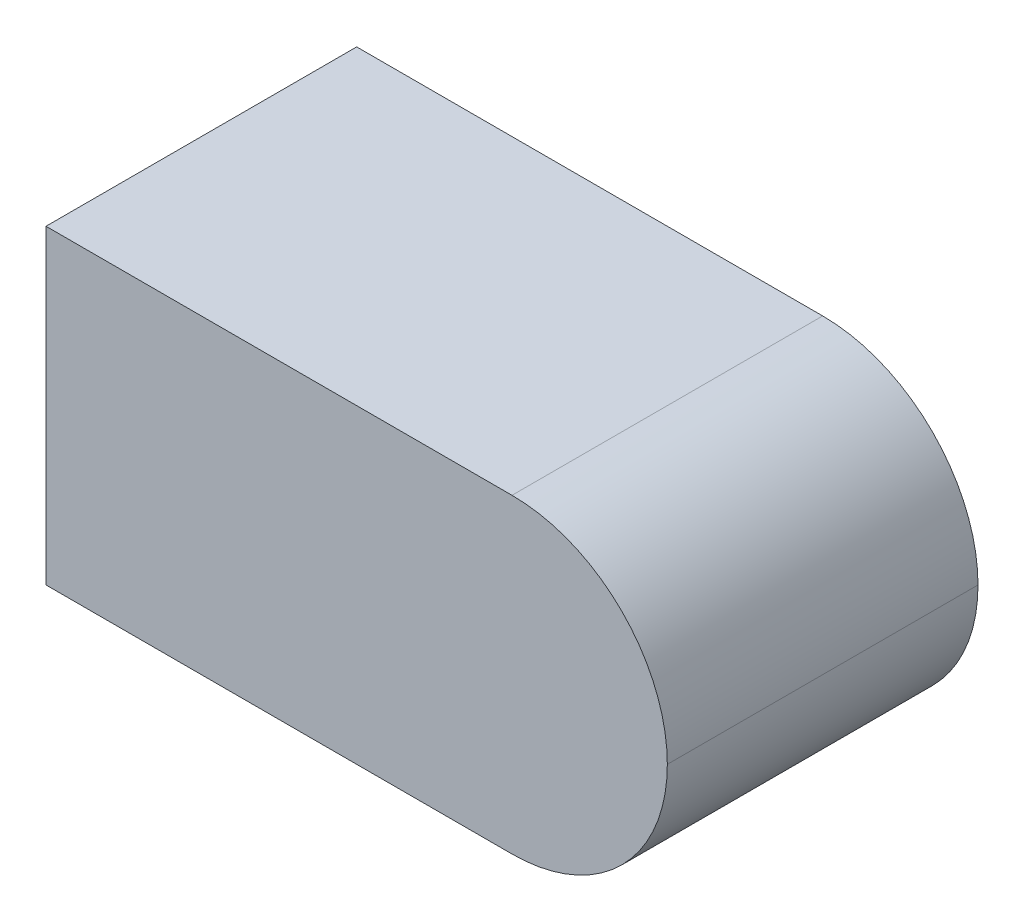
ISO-10303-21;
HEADER;
FILE_DESCRIPTION(('STEP AP214'),'2;1');
FILE_NAME('part.step','',(''),(''),'','','');
FILE_SCHEMA(('AUTOMOTIVE_DESIGN { 1 0 10303 214 1 1 1 1 }'));
ENDSEC;
DATA;
#1=APPLICATION_CONTEXT('core data for automotive mechanical design processes');
#2=APPLICATION_PROTOCOL_DEFINITION('international standard','automotive_design',2000,#1);
#3=PRODUCT_CONTEXT('',#1,'mechanical');
#4=PRODUCT('Part','Part','',(#3));
#5=PRODUCT_RELATED_PRODUCT_CATEGORY('part','',(#4));
#6=PRODUCT_DEFINITION_FORMATION('','',#4);
#7=PRODUCT_DEFINITION_CONTEXT('part definition',#1,'design');
#8=PRODUCT_DEFINITION('design','',#6,#7);
#9=PRODUCT_DEFINITION_SHAPE('','',#8);
#10=(LENGTH_UNIT() NAMED_UNIT(*) SI_UNIT(.MILLI.,.METRE.));
#11=(NAMED_UNIT(*) PLANE_ANGLE_UNIT() SI_UNIT($,.RADIAN.));
#12=(NAMED_UNIT(*) SI_UNIT($,.STERADIAN.) SOLID_ANGLE_UNIT());
#13=UNCERTAINTY_MEASURE_WITH_UNIT(LENGTH_MEASURE(1.E-05),#10,'distance_accuracy_value','');
#14=(GEOMETRIC_REPRESENTATION_CONTEXT(3) GLOBAL_UNCERTAINTY_ASSIGNED_CONTEXT((#13)) GLOBAL_UNIT_ASSIGNED_CONTEXT((#10,
#11,#12)) REPRESENTATION_CONTEXT('',''));
#15=CARTESIAN_POINT('',(0.,0.,0.));
#16=DIRECTION('',(0.,0.,1.));
#17=DIRECTION('',(1.,0.,0.));
#18=AXIS2_PLACEMENT_3D('',#15,#16,#17);
#19=CARTESIAN_POINT('',(0.,10.,0.));
#20=DIRECTION('',(1.,0.,0.));
#21=DIRECTION('',(0.,0.,-1.));
#22=AXIS2_PLACEMENT_3D('',#19,#20,#21);
#23=PLANE('',#22);
#24=DIRECTION('',(0.,0.,1.));
#25=VECTOR('',#24,1.);
#26=CARTESIAN_POINT('',(0.,0.,0.));
#27=LINE('',#26,#25);
#28=CARTESIAN_POINT('',(0.,0.,-10.));
#29=VERTEX_POINT('',#28);
#30=CARTESIAN_POINT('',(0.,0.,0.));
#31=VERTEX_POINT('',#30);
#32=EDGE_CURVE('E80',#29,#31,#27,.T.);
#33=ORIENTED_EDGE('',*,*,#32,.T.);
#34=DIRECTION('',(0.,-1.,0.));
#35=VECTOR('',#34,1.);
#36=CARTESIAN_POINT('',(0.,10.,0.));
#37=LINE('',#36,#35);
#38=CARTESIAN_POINT('',(0.,10.,0.));
#39=VERTEX_POINT('',#38);
#40=EDGE_CURVE('E86',#39,#31,#37,.T.);
#41=ORIENTED_EDGE('',*,*,#40,.F.);
#42=DIRECTION('',(0.,0.,1.));
#43=VECTOR('',#42,1.);
#44=CARTESIAN_POINT('',(0.,10.,0.));
#45=LINE('',#44,#43);
#46=CARTESIAN_POINT('',(0.,10.,-10.));
#47=VERTEX_POINT('',#46);
#48=EDGE_CURVE('E103',#47,#39,#45,.T.);
#49=ORIENTED_EDGE('',*,*,#48,.F.);
#50=DIRECTION('',(0.,-1.,0.));
#51=VECTOR('',#50,1.);
#52=CARTESIAN_POINT('',(0.,10.,-10.));
#53=LINE('',#52,#51);
#54=EDGE_CURVE('E93',#47,#29,#53,.T.);
#55=ORIENTED_EDGE('',*,*,#54,.T.);
#56=EDGE_LOOP('',(#33,#41,#49,#55));
#57=FACE_BOUND('',#56,.T.);
#58=ADVANCED_FACE('F33',(#57),#23,.F.);
#59=CARTESIAN_POINT('',(0.,10.,0.));
#60=DIRECTION('',(0.,0.,-1.));
#61=DIRECTION('',(-1.,0.,0.));
#62=AXIS2_PLACEMENT_3D('',#59,#60,#61);
#63=PLANE('',#62);
#64=DIRECTION('',(1.,0.,0.));
#65=VECTOR('',#64,1.);
#66=CARTESIAN_POINT('',(0.,0.,0.));
#67=LINE('',#66,#65);
#68=CARTESIAN_POINT('',(15.,0.,0.));
#69=VERTEX_POINT('',#68);
#70=EDGE_CURVE('E75',#31,#69,#67,.T.);
#71=ORIENTED_EDGE('',*,*,#70,.T.);
#72=CARTESIAN_POINT('',(15.,5.,0.));
#73=DIRECTION('',(0.,0.,-1.));
#74=DIRECTION('',(-1.,0.,0.));
#75=AXIS2_PLACEMENT_3D('',#72,#73,#74);
#76=CIRCLE('',#75,5.);
#77=CARTESIAN_POINT('',(20.,5.,0.));
#78=VERTEX_POINT('',#77);
#79=EDGE_CURVE('E40',#69,#78,#76,.F.);
#80=ORIENTED_EDGE('',*,*,#79,.T.);
#81=CARTESIAN_POINT('',(15.,5.,0.));
#82=DIRECTION('',(0.,0.,-1.));
#83=DIRECTION('',(-1.,0.,0.));
#84=AXIS2_PLACEMENT_3D('',#81,#82,#83);
#85=CIRCLE('',#84,5.);
#86=CARTESIAN_POINT('',(15.,10.,0.));
#87=VERTEX_POINT('',#86);
#88=EDGE_CURVE('E47',#78,#87,#85,.F.);
#89=ORIENTED_EDGE('',*,*,#88,.T.);
#90=DIRECTION('',(1.,0.,0.));
#91=VECTOR('',#90,1.);
#92=CARTESIAN_POINT('',(0.,10.,0.));
#93=LINE('',#92,#91);
#94=EDGE_CURVE('E88',#39,#87,#93,.T.);
#95=ORIENTED_EDGE('',*,*,#94,.F.);
#96=ORIENTED_EDGE('',*,*,#40,.T.);
#97=EDGE_LOOP('',(#71,#80,#89,#95,#96));
#98=FACE_BOUND('',#97,.T.);
#99=ADVANCED_FACE('F87',(#98),#63,.F.);
#100=CARTESIAN_POINT('',(0.,10.,-10.));
#101=DIRECTION('',(0.,0.,1.));
#102=DIRECTION('',(1.,0.,0.));
#103=AXIS2_PLACEMENT_3D('',#100,#101,#102);
#104=PLANE('',#103);
#105=CARTESIAN_POINT('',(15.,5.,-10.));
#106=DIRECTION('',(0.,0.,1.));
#107=DIRECTION('',(1.,0.,0.));
#108=AXIS2_PLACEMENT_3D('',#105,#106,#107);
#109=CIRCLE('',#108,5.);
#110=CARTESIAN_POINT('',(15.,10.,-10.));
#111=VERTEX_POINT('',#110);
#112=CARTESIAN_POINT('',(20.,5.,-10.));
#113=VERTEX_POINT('',#112);
#114=EDGE_CURVE('E92',#111,#113,#109,.F.);
#115=ORIENTED_EDGE('',*,*,#114,.T.);
#116=CARTESIAN_POINT('',(15.,5.,-10.));
#117=DIRECTION('',(0.,0.,1.));
#118=DIRECTION('',(1.,0.,0.));
#119=AXIS2_PLACEMENT_3D('',#116,#117,#118);
#120=CIRCLE('',#119,5.);
#121=CARTESIAN_POINT('',(15.,0.,-10.));
#122=VERTEX_POINT('',#121);
#123=EDGE_CURVE('E110',#113,#122,#120,.F.);
#124=ORIENTED_EDGE('',*,*,#123,.T.);
#125=DIRECTION('',(-1.,0.,0.));
#126=VECTOR('',#125,1.);
#127=CARTESIAN_POINT('',(0.,0.,-10.));
#128=LINE('',#127,#126);
#129=EDGE_CURVE('E83',#122,#29,#128,.T.);
#130=ORIENTED_EDGE('',*,*,#129,.T.);
#131=ORIENTED_EDGE('',*,*,#54,.F.);
#132=DIRECTION('',(-1.,0.,0.));
#133=VECTOR('',#132,1.);
#134=CARTESIAN_POINT('',(0.,10.,-10.));
#135=LINE('',#134,#133);
#136=EDGE_CURVE('E106',#111,#47,#135,.T.);
#137=ORIENTED_EDGE('',*,*,#136,.F.);
#138=EDGE_LOOP('',(#115,#124,#130,#131,#137));
#139=FACE_BOUND('',#138,.T.);
#140=ADVANCED_FACE('F115',(#139),#104,.F.);
#141=CARTESIAN_POINT('',(0.,10.,0.));
#142=DIRECTION('',(0.,-1.,0.));
#143=DIRECTION('',(0.,0.,-1.));
#144=AXIS2_PLACEMENT_3D('',#141,#142,#143);
#145=PLANE('',#144);
#146=ORIENTED_EDGE('',*,*,#94,.T.);
#147=DIRECTION('',(0.,0.,-1.));
#148=VECTOR('',#147,1.);
#149=CARTESIAN_POINT('',(15.,10.,0.));
#150=LINE('',#149,#148);
#151=EDGE_CURVE('E11',#87,#111,#150,.T.);
#152=ORIENTED_EDGE('',*,*,#151,.T.);
#153=ORIENTED_EDGE('',*,*,#136,.T.);
#154=ORIENTED_EDGE('',*,*,#48,.T.);
#155=EDGE_LOOP('',(#146,#152,#153,#154));
#156=FACE_BOUND('',#155,.T.);
#157=ADVANCED_FACE('F125',(#156),#145,.F.);
#158=CARTESIAN_POINT('',(0.,0.,0.));
#159=DIRECTION('',(0.,-1.,0.));
#160=DIRECTION('',(0.,0.,-1.));
#161=AXIS2_PLACEMENT_3D('',#158,#159,#160);
#162=PLANE('',#161);
#163=ORIENTED_EDGE('',*,*,#129,.F.);
#164=DIRECTION('',(0.,0.,-1.));
#165=VECTOR('',#164,1.);
#166=CARTESIAN_POINT('',(15.,0.,0.));
#167=LINE('',#166,#165);
#168=EDGE_CURVE('E82',#122,#69,#167,.F.);
#169=ORIENTED_EDGE('',*,*,#168,.T.);
#170=ORIENTED_EDGE('',*,*,#70,.F.);
#171=ORIENTED_EDGE('',*,*,#32,.F.);
#172=EDGE_LOOP('',(#163,#169,#170,#171));
#173=FACE_BOUND('',#172,.T.);
#174=ADVANCED_FACE('F78',(#173),#162,.T.);
#175=CARTESIAN_POINT('',(15.,5.,0.));
#176=DIRECTION('',(0.,0.,-1.));
#177=DIRECTION('',(-1.,0.,0.));
#178=AXIS2_PLACEMENT_3D('',#175,#176,#177);
#179=CYLINDRICAL_SURFACE('',#178,5.);
#180=ORIENTED_EDGE('',*,*,#151,.F.);
#181=ORIENTED_EDGE('',*,*,#88,.F.);
#182=DIRECTION('',(0.,0.,-1.));
#183=VECTOR('',#182,1.);
#184=CARTESIAN_POINT('',(20.,5.,0.));
#185=LINE('',#184,#183);
#186=EDGE_CURVE('E97',#113,#78,#185,.F.);
#187=ORIENTED_EDGE('',*,*,#186,.F.);
#188=ORIENTED_EDGE('',*,*,#114,.F.);
#189=EDGE_LOOP('',(#180,#181,#187,#188));
#190=FACE_BOUND('',#189,.T.);
#191=ADVANCED_FACE('F123',(#190),#179,.T.);
#192=CARTESIAN_POINT('',(15.,5.,0.));
#193=DIRECTION('',(0.,0.,1.));
#194=DIRECTION('',(1.,0.,0.));
#195=AXIS2_PLACEMENT_3D('',#192,#193,#194);
#196=CYLINDRICAL_SURFACE('',#195,5.);
#197=ORIENTED_EDGE('',*,*,#79,.F.);
#198=ORIENTED_EDGE('',*,*,#168,.F.);
#199=ORIENTED_EDGE('',*,*,#123,.F.);
#200=ORIENTED_EDGE('',*,*,#186,.T.);
#201=EDGE_LOOP('',(#197,#198,#199,#200));
#202=FACE_BOUND('',#201,.T.);
#203=ADVANCED_FACE('F120',(#202),#196,.T.);
#204=CLOSED_SHELL('',(#58,#99,#140,#157,#174,#191,#203));
#205=MANIFOLD_SOLID_BREP('B2',#204);
#206=ADVANCED_BREP_SHAPE_REPRESENTATION('',(#18,#205),#14);
#207=SHAPE_DEFINITION_REPRESENTATION(#9,#206);
ENDSEC;
END-ISO-10303-21;
